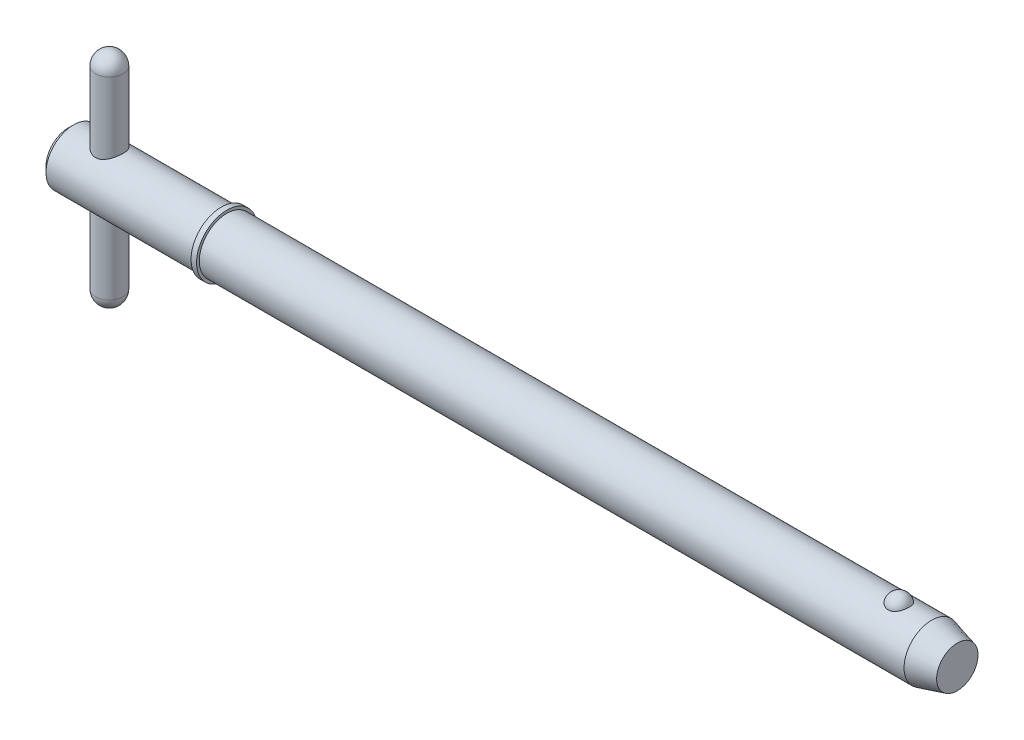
ISO-10303-21;
HEADER;
FILE_DESCRIPTION(('STEP AP214'),'2;1');
FILE_NAME('part.step','',(''),(''),'','','');
FILE_SCHEMA(('AUTOMOTIVE_DESIGN { 1 0 10303 214 1 1 1 1 }'));
ENDSEC;
DATA;
#1=APPLICATION_CONTEXT('core data for automotive mechanical design processes');
#2=APPLICATION_PROTOCOL_DEFINITION('international standard','automotive_design',2000,#1);
#3=PRODUCT_CONTEXT('',#1,'mechanical');
#4=PRODUCT('Part','Part','',(#3));
#5=PRODUCT_RELATED_PRODUCT_CATEGORY('part','',(#4));
#6=PRODUCT_DEFINITION_FORMATION('','',#4);
#7=PRODUCT_DEFINITION_CONTEXT('part definition',#1,'design');
#8=PRODUCT_DEFINITION('design','',#6,#7);
#9=PRODUCT_DEFINITION_SHAPE('','',#8);
#10=(LENGTH_UNIT() NAMED_UNIT(*) SI_UNIT(.MILLI.,.METRE.));
#11=(NAMED_UNIT(*) PLANE_ANGLE_UNIT() SI_UNIT($,.RADIAN.));
#12=(NAMED_UNIT(*) SI_UNIT($,.STERADIAN.) SOLID_ANGLE_UNIT());
#13=UNCERTAINTY_MEASURE_WITH_UNIT(LENGTH_MEASURE(1.E-05),#10,'distance_accuracy_value','');
#14=(GEOMETRIC_REPRESENTATION_CONTEXT(3) GLOBAL_UNCERTAINTY_ASSIGNED_CONTEXT((#13)) GLOBAL_UNIT_ASSIGNED_CONTEXT((#10,
#11,#12)) REPRESENTATION_CONTEXT('',''));
#15=CARTESIAN_POINT('',(0.,0.,0.));
#16=DIRECTION('',(0.,0.,1.));
#17=DIRECTION('',(1.,0.,0.));
#18=AXIS2_PLACEMENT_3D('',#15,#16,#17);
#19=CARTESIAN_POINT('',(4.755,12.7,0.));
#20=DIRECTION('',(0.,-1.,0.));
#21=DIRECTION('',(0.,0.,-1.));
#22=AXIS2_PLACEMENT_3D('',#19,#20,#21);
#23=CYLINDRICAL_SURFACE('',#22,1.585);
#24=CARTESIAN_POINT('',(4.755,-11.115,0.));
#25=DIRECTION('',(0.,-1.,0.));
#26=DIRECTION('',(0.,0.,-1.));
#27=AXIS2_PLACEMENT_3D('',#24,#25,#26);
#28=CIRCLE('',#27,1.585);
#29=CARTESIAN_POINT('',(4.755,-11.115,-1.585));
#30=VERTEX_POINT('',#29);
#31=EDGE_CURVE('P0_E10',#30,#30,#28,.F.);
#32=ORIENTED_EDGE('',*,*,#31,.T.);
#33=EDGE_LOOP('',(#32));
#34=FACE_BOUND('',#33,.T.);
#35=CARTESIAN_POINT('',(4.755,11.115,0.));
#36=DIRECTION('',(0.,-1.,0.));
#37=DIRECTION('',(0.,0.,-1.));
#38=AXIS2_PLACEMENT_3D('',#35,#36,#37);
#39=CIRCLE('',#38,1.585);
#40=CARTESIAN_POINT('',(4.755,11.115,-1.585));
#41=VERTEX_POINT('',#40);
#42=EDGE_CURVE('P0_E21',#41,#41,#39,.T.);
#43=ORIENTED_EDGE('',*,*,#42,.T.);
#44=EDGE_LOOP('',(#43));
#45=FACE_BOUND('',#44,.T.);
#46=ADVANCED_FACE('P0_F14',(#34,#45),#23,.T.);
#47=CARTESIAN_POINT('',(4.755,-11.115,0.));
#48=DIRECTION('',(0.,0.,1.));
#49=DIRECTION('',(1.,0.,0.));
#50=AXIS2_PLACEMENT_3D('',#47,#48,#49);
#51=SPHERICAL_SURFACE('',#50,1.585);
#52=CARTESIAN_POINT('',(4.755,-11.115,0.));
#53=DIRECTION('',(0.,-1.,0.));
#54=DIRECTION('',(0.,0.,-1.));
#55=AXIS2_PLACEMENT_3D('',#52,#53,#54);
#56=SPHERICAL_SURFACE('',#55,1.585);
#57=ORIENTED_EDGE('',*,*,#31,.F.);
#58=EDGE_LOOP('',(#57));
#59=FACE_BOUND('',#58,.T.);
#60=ADVANCED_FACE('P0_F29',(#59),#56,.T.);
#61=CARTESIAN_POINT('',(4.755,11.115,0.));
#62=DIRECTION('',(0.,0.,1.));
#63=DIRECTION('',(1.,0.,0.));
#64=AXIS2_PLACEMENT_3D('',#61,#62,#63);
#65=SPHERICAL_SURFACE('',#64,1.585);
#66=CARTESIAN_POINT('',(4.755,11.115,0.));
#67=DIRECTION('',(0.,-1.,0.));
#68=DIRECTION('',(0.,0.,-1.));
#69=AXIS2_PLACEMENT_3D('',#66,#67,#68);
#70=SPHERICAL_SURFACE('',#69,1.585);
#71=ORIENTED_EDGE('',*,*,#42,.F.);
#72=EDGE_LOOP('',(#71));
#73=FACE_BOUND('',#72,.T.);
#74=ADVANCED_FACE('P0_F16',(#73),#70,.T.);
#75=CLOSED_SHELL('',(#46,#60,#74));
#76=MANIFOLD_SOLID_BREP('P0_B1',#75);
#77=CARTESIAN_POINT('',(0.,0.,0.));
#78=DIRECTION('',(1.,0.,0.));
#79=DIRECTION('',(0.,0.,-1.));
#80=AXIS2_PLACEMENT_3D('',#77,#78,#79);
#81=CYLINDRICAL_SURFACE('',#80,3.175);
#82=CARTESIAN_POINT('',(99.4476846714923,0.,0.));
#83=DIRECTION('',(1.,0.,0.));
#84=DIRECTION('',(0.,0.,-1.));
#85=AXIS2_PLACEMENT_3D('',#82,#83,#84);
#86=CIRCLE('',#85,3.175);
#87=CARTESIAN_POINT('',(99.4476846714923,0.,-3.175));
#88=VERTEX_POINT('',#87);
#89=EDGE_CURVE('P1_E81',#88,#88,#86,.T.);
#90=ORIENTED_EDGE('',*,*,#89,.F.);
#91=EDGE_LOOP('',(#90));
#92=FACE_BOUND('',#91,.T.);
#93=CARTESIAN_POINT('',(18.29,0.,0.));
#94=DIRECTION('',(1.,0.,0.));
#95=DIRECTION('',(0.,0.,-1.));
#96=AXIS2_PLACEMENT_3D('',#93,#94,#95);
#97=CIRCLE('',#96,3.175);
#98=CARTESIAN_POINT('',(18.29,0.,-3.175));
#99=VERTEX_POINT('',#98);
#100=EDGE_CURVE('P1_E85',#99,#99,#97,.T.);
#101=ORIENTED_EDGE('',*,*,#100,.T.);
#102=EDGE_LOOP('',(#101));
#103=FACE_BOUND('',#102,.T.);
#104=CARTESIAN_POINT('',(95.6757276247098,2.92898950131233,1.2254164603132));
#105=CARTESIAN_POINT('',(95.612316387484,2.92899434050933,1.22541146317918));
#106=CARTESIAN_POINT('',(95.5487979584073,2.93112688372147,1.2203464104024));
#107=CARTESIAN_POINT('',(95.4235306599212,2.93942752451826,1.20020949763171));
#108=CARTESIAN_POINT('',(95.3617869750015,2.9456063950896,1.1851109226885));
#109=CARTESIAN_POINT('',(95.2420651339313,2.96127115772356,1.14540352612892));
#110=CARTESIAN_POINT('',(95.1840775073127,2.97074831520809,1.12081980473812));
#111=CARTESIAN_POINT('',(95.0731943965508,2.99197584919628,1.06285154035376));
#112=CARTESIAN_POINT('',(95.0202966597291,3.0037252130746,1.02947091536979));
#113=CARTESIAN_POINT('',(94.9192688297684,3.02865714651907,0.953674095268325));
#114=CARTESIAN_POINT('',(94.871324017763,3.04187163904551,0.911021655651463));
#115=CARTESIAN_POINT('',(94.7830360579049,3.06808741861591,0.818400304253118));
#116=CARTESIAN_POINT('',(94.7426952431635,3.08108863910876,0.768429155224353));
#117=CARTESIAN_POINT('',(94.6688039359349,3.10614903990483,0.660064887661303));
#118=CARTESIAN_POINT('',(94.6356330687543,3.11814104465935,0.601396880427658));
#119=CARTESIAN_POINT('',(94.5791190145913,3.13926931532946,0.479026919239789));
#120=CARTESIAN_POINT('',(94.5557764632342,3.14840539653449,0.415324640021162));
#121=CARTESIAN_POINT('',(94.5191785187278,3.16298160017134,0.283885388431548));
#122=CARTESIAN_POINT('',(94.5060407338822,3.16837855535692,0.216110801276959));
#123=CARTESIAN_POINT('',(94.4905676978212,3.17475386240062,0.0791367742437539));
#124=CARTESIAN_POINT('',(94.488232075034,3.17573236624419,0.00993738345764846));
#125=CARTESIAN_POINT('',(94.4943886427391,3.17318075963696,-0.127420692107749));
#126=CARTESIAN_POINT('',(94.5028073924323,3.16968122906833,-0.19558325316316));
#127=CARTESIAN_POINT('',(94.5301752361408,3.1585790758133,-0.329413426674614));
#128=CARTESIAN_POINT('',(94.5491245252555,3.15097637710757,-0.395080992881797));
#129=CARTESIAN_POINT('',(94.5972057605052,3.13242485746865,-0.5221806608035));
#130=CARTESIAN_POINT('',(94.6263524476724,3.12147119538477,-0.583606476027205));
#131=CARTESIAN_POINT('',(94.6942352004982,3.09734973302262,-0.700436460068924));
#132=CARTESIAN_POINT('',(94.732972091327,3.08418174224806,-0.755840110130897));
#133=CARTESIAN_POINT('',(94.8194771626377,3.05694884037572,-0.859404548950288));
#134=CARTESIAN_POINT('',(94.8672961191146,3.04287919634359,-0.907521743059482));
#135=CARTESIAN_POINT('',(94.9707353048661,3.01548927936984,-0.994758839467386));
#136=CARTESIAN_POINT('',(95.0263549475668,3.0021689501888,-1.03387941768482));
#137=CARTESIAN_POINT('',(95.1428093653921,2.97810316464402,-1.10126594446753));
#138=CARTESIAN_POINT('',(95.2035182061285,2.96731170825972,-1.12973256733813));
#139=CARTESIAN_POINT('',(95.3293712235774,2.94928934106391,-1.17598467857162));
#140=CARTESIAN_POINT('',(95.3945137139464,2.94205708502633,-1.19377420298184));
#141=CARTESIAN_POINT('',(95.5238562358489,2.93233065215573,-1.21746387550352));
#142=CARTESIAN_POINT('',(95.5879385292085,2.92961621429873,-1.22391763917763));
#143=CARTESIAN_POINT('',(95.7163375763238,2.92855752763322,-1.22644976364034));
#144=CARTESIAN_POINT('',(95.7806542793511,2.93021238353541,-1.22253024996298));
#145=CARTESIAN_POINT('',(95.9055239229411,2.9375685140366,-1.20474140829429));
#146=CARTESIAN_POINT('',(95.966131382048,2.94313790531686,-1.19119621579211));
#147=CARTESIAN_POINT('',(96.0841106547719,2.95756226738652,-1.15491492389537));
#148=CARTESIAN_POINT('',(96.1414822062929,2.96641750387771,-1.13217808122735));
#149=CARTESIAN_POINT('',(96.2527699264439,2.98669918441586,-1.07755083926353));
#150=CARTESIAN_POINT('',(96.3065845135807,2.9981771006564,-1.04547308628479));
#151=CARTESIAN_POINT('',(96.4081473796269,3.02240235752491,-0.973220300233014));
#152=CARTESIAN_POINT('',(96.4558942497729,3.03514999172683,-0.933043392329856));
#153=CARTESIAN_POINT('',(96.5465817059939,3.06131230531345,-0.843372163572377));
#154=CARTESIAN_POINT('',(96.5891588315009,3.07472822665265,-0.793510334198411));
#155=CARTESIAN_POINT('',(96.6656765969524,3.10021106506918,-0.687241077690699));
#156=CARTESIAN_POINT('',(96.6996156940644,3.1122777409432,-0.630832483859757));
#157=CARTESIAN_POINT('',(96.7591209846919,3.134208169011,-0.51105938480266));
#158=CARTESIAN_POINT('',(96.7843892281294,3.14399040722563,-0.447531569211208));
#159=CARTESIAN_POINT('',(96.8245117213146,3.15983820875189,-0.31682749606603));
#160=CARTESIAN_POINT('',(96.8393659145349,3.16590375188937,-0.249651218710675));
#161=CARTESIAN_POINT('',(96.858358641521,3.17370076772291,-0.113549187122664));
#162=CARTESIAN_POINT('',(96.8624966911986,3.17543204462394,-0.0446233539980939));
#163=CARTESIAN_POINT('',(96.8599697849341,3.17438372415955,0.0929938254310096));
#164=CARTESIAN_POINT('',(96.8533050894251,3.17160423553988,0.16168517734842));
#165=CARTESIAN_POINT('',(96.8293754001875,3.1618438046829,0.296502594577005));
#166=CARTESIAN_POINT('',(96.8121674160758,3.15488546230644,0.362640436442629));
#167=CARTESIAN_POINT('',(96.767547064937,3.13748892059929,0.490896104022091));
#168=CARTESIAN_POINT('',(96.7401339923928,3.12705048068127,0.553013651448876));
#169=CARTESIAN_POINT('',(96.6754626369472,3.10369139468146,0.671876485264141));
#170=CARTESIAN_POINT('',(96.6381467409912,3.0907563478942,0.728587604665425));
#171=CARTESIAN_POINT('',(96.5545246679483,3.06381731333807,0.834653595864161));
#172=CARTESIAN_POINT('',(96.5082189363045,3.04981337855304,0.884008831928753));
#173=CARTESIAN_POINT('',(96.407718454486,3.02230423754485,0.973916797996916));
#174=CARTESIAN_POINT('',(96.353535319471,3.00879833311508,1.01448227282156));
#175=CARTESIAN_POINT('',(96.2385299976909,2.98383625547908,1.0857155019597));
#176=CARTESIAN_POINT('',(96.1777053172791,2.9723808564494,1.11637952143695));
#177=CARTESIAN_POINT('',(96.0533690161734,2.95329063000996,1.16592590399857));
#178=CARTESIAN_POINT('',(95.9900230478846,2.9455373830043,1.18517901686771));
#179=CARTESIAN_POINT('',(95.8607664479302,2.9342556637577,1.21284802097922));
#180=CARTESIAN_POINT('',(95.7948641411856,2.93071450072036,1.2212964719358));
#181=CARTESIAN_POINT('',(95.711116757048,2.9291525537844,1.22502505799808));
#182=CARTESIAN_POINT('',(95.6934263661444,2.92898815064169,1.22541785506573));
#183=CARTESIAN_POINT('',(95.6757276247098,2.92898950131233,1.2254164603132));
#184=B_SPLINE_CURVE_WITH_KNOTS('',3,(#104,#105,#106,#107,#108,#109,#110,#111,#112,#113,#114,
#115,#116,#117,#118,#119,#120,#121,#122,#123,#124,#125,#126,#127,#128,#129,#130,#131,#132,#133,
#134,#135,#136,#137,#138,#139,#140,#141,#142,#143,#144,#145,#146,#147,#148,#149,#150,#151,#152,
#153,#154,#155,#156,#157,#158,#159,#160,#161,#162,#163,#164,#165,#166,#167,#168,#169,#170,#171,
#172,#173,#174,#175,#176,#177,#178,#179,#180,#181,#182,#183),.UNSPECIFIED.,.T.,.F.,(4,2,2,2,2,2,
2,2,2,2,2,2,2,2,2,2,2,2,2,2,2,2,2,2,2,2,2,2,2,2,2,2,2,2,2,2,2,2,2,4),(0.,0.190186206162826,
0.380880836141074,0.571074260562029,0.761183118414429,0.956866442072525,1.15260970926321,
1.3570177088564,1.56143892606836,1.76818248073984,1.97491892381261,2.18025109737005,
2.38558707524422,2.59122111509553,2.79687285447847,3.00371012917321,3.2105318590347,
3.41323429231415,3.61586005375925,3.80828192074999,4.00066436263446,4.18685798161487,
4.37306665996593,4.56330302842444,4.75358348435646,4.95345287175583,5.15335793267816,
5.35957003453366,5.56578325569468,5.7720057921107,5.97822335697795,6.18333558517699,
6.38846199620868,6.59480900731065,6.80114579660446,7.00718137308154,7.21329457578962,
7.41228022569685,7.61066481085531,7.66374777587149),.UNSPECIFIED.);
#185=CARTESIAN_POINT('',(95.6757276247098,2.92898950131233,1.2254164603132));
#186=VERTEX_POINT('',#185);
#187=EDGE_CURVE('P1_E35',#186,#186,#184,.T.);
#188=ORIENTED_EDGE('',*,*,#187,.T.);
#189=EDGE_LOOP('',(#188));
#190=FACE_BOUND('',#189,.T.);
#191=ADVANCED_FACE('P1_F13',(#92,#103,#190),#81,.T.);
#192=CARTESIAN_POINT('',(0.,0.,0.));
#193=DIRECTION('',(-1.,0.,0.));
#194=DIRECTION('',(0.,0.,1.));
#195=AXIS2_PLACEMENT_3D('',#192,#193,#194);
#196=PLANE('',#195);
#197=CARTESIAN_POINT('',(0.,0.,0.));
#198=DIRECTION('',(1.,0.,0.));
#199=DIRECTION('',(0.,0.,-1.));
#200=AXIS2_PLACEMENT_3D('',#197,#198,#199);
#201=CIRCLE('',#200,2.54);
#202=CARTESIAN_POINT('',(0.,0.,-2.54));
#203=VERTEX_POINT('',#202);
#204=EDGE_CURVE('P1_E9',#203,#203,#201,.T.);
#205=ORIENTED_EDGE('',*,*,#204,.F.);
#206=EDGE_LOOP('',(#205));
#207=FACE_BOUND('',#206,.T.);
#208=ADVANCED_FACE('P1_F15',(#207),#196,.T.);
#209=CARTESIAN_POINT('',(0.634999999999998,0.,0.));
#210=DIRECTION('',(1.,0.,0.));
#211=DIRECTION('',(0.,0.,-1.));
#212=AXIS2_PLACEMENT_3D('',#209,#210,#211);
#213=CONICAL_SURFACE('',#212,3.175,0.78539816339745);
#214=ORIENTED_EDGE('',*,*,#204,.T.);
#215=EDGE_LOOP('',(#214));
#216=FACE_BOUND('',#215,.T.);
#217=CARTESIAN_POINT('',(0.634999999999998,0.,0.));
#218=DIRECTION('',(1.,0.,0.));
#219=DIRECTION('',(0.,0.,-1.));
#220=AXIS2_PLACEMENT_3D('',#217,#218,#219);
#221=CIRCLE('',#220,3.175);
#222=CARTESIAN_POINT('',(0.634999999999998,0.,-3.175));
#223=VERTEX_POINT('',#222);
#224=EDGE_CURVE('P1_E26',#223,#223,#221,.T.);
#225=ORIENTED_EDGE('',*,*,#224,.F.);
#226=EDGE_LOOP('',(#225));
#227=FACE_BOUND('',#226,.T.);
#228=ADVANCED_FACE('P1_F77',(#216,#227),#213,.T.);
#229=CARTESIAN_POINT('',(0.,0.,0.));
#230=DIRECTION('',(1.,0.,0.));
#231=DIRECTION('',(0.,0.,-1.));
#232=AXIS2_PLACEMENT_3D('',#229,#230,#231);
#233=CYLINDRICAL_SURFACE('',#232,3.175);
#234=CARTESIAN_POINT('',(4.755,-2.75107251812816,1.585));
#235=CARTESIAN_POINT('',(4.67238891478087,-2.7510796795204,1.58499425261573));
#236=CARTESIAN_POINT('',(4.58967306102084,-2.75485010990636,1.57849830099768));
#237=CARTESIAN_POINT('',(4.42677850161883,-2.76938647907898,1.55284486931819));
#238=CARTESIAN_POINT('',(4.34660551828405,-2.78016716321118,1.53366069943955));
#239=CARTESIAN_POINT('',(4.19146029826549,-2.80716278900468,1.48366329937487));
#240=CARTESIAN_POINT('',(4.11646293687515,-2.8233488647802,1.45291173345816));
#241=CARTESIAN_POINT('',(3.97271079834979,-2.85928672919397,1.38084067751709));
#242=CARTESIAN_POINT('',(3.90395634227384,-2.87903870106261,1.33952064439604));
#243=CARTESIAN_POINT('',(3.76839976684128,-2.921867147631,1.24350234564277));
#244=CARTESIAN_POINT('',(3.702222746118,-2.94508343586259,1.18798355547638));
#245=CARTESIAN_POINT('',(3.5796334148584,-2.99109588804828,1.06685014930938));
#246=CARTESIAN_POINT('',(3.52322596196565,-3.01389183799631,1.00123054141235));
#247=CARTESIAN_POINT('',(3.41807024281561,-3.05832598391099,0.856373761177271));
#248=CARTESIAN_POINT('',(3.37009053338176,-3.07978367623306,0.776518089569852));
#249=CARTESIAN_POINT('',(3.28853137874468,-3.11730894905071,0.608596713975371));
#250=CARTESIAN_POINT('',(3.25494287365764,-3.1333799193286,0.520536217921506));
#251=CARTESIAN_POINT('',(3.20559401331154,-3.15731341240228,0.345327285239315));
#252=CARTESIAN_POINT('',(3.18873760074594,-3.16567752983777,0.258557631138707));
#253=CARTESIAN_POINT('',(3.16972238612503,-3.17512718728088,0.0830496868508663));
#254=CARTESIAN_POINT('',(3.16755472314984,-3.17621711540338,-0.00568738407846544));
#255=CARTESIAN_POINT('',(3.1775542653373,-3.17123385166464,-0.174372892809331));
#256=CARTESIAN_POINT('',(3.18849502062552,-3.16577346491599,-0.254416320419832));
#257=CARTESIAN_POINT('',(3.22220680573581,-3.14922844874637,-0.411354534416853));
#258=CARTESIAN_POINT('',(3.2449787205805,-3.13814339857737,-0.488249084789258));
#259=CARTESIAN_POINT('',(3.30185558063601,-3.111172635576,-0.638050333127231));
#260=CARTESIAN_POINT('',(3.33611332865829,-3.09522247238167,-0.710886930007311));
#261=CARTESIAN_POINT('',(3.41477890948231,-3.05996035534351,-0.849953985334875));
#262=CARTESIAN_POINT('',(3.45919037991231,-3.04064719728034,-0.916182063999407));
#263=CARTESIAN_POINT('',(3.5617148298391,-2.99832415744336,-1.04681642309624));
#264=CARTESIAN_POINT('',(3.62072497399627,-2.97513741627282,-1.11046186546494));
#265=CARTESIAN_POINT('',(3.7483697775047,-2.92885066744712,-1.22736291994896));
#266=CARTESIAN_POINT('',(3.81701173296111,-2.90575073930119,-1.2806105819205));
#267=CARTESIAN_POINT('',(3.96727993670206,-2.86067370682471,-1.37849835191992));
#268=CARTESIAN_POINT('',(4.04945242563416,-2.83885964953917,-1.42238246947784));
#269=CARTESIAN_POINT('',(4.2213558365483,-2.80110454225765,-1.49537418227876));
#270=CARTESIAN_POINT('',(4.3110787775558,-2.78515738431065,-1.52449715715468));
#271=CARTESIAN_POINT('',(4.48806324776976,-2.76271292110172,-1.56478065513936));
#272=CARTESIAN_POINT('',(4.57495732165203,-2.75556745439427,-1.57718067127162));
#273=CARTESIAN_POINT('',(4.74985771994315,-2.74969306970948,-1.58740564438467));
#274=CARTESIAN_POINT('',(4.8378632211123,-2.75095824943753,-1.58524082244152));
#275=CARTESIAN_POINT('',(5.00227282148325,-2.76107477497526,-1.56753530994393));
#276=CARTESIAN_POINT('',(5.07889680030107,-2.76908515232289,-1.55347662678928));
#277=CARTESIAN_POINT('',(5.22855309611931,-2.79054849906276,-1.51458035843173));
#278=CARTESIAN_POINT('',(5.30158424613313,-2.80400322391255,-1.489739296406));
#279=CARTESIAN_POINT('',(5.44583114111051,-2.83556995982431,-1.42877335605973));
#280=CARTESIAN_POINT('',(5.51680600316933,-2.85386886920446,-1.39217900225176));
#281=CARTESIAN_POINT('',(5.6520174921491,-2.89289503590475,-1.30915485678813));
#282=CARTESIAN_POINT('',(5.71625063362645,-2.91362353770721,-1.26272001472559));
#283=CARTESIAN_POINT('',(5.8445938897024,-2.95830220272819,-1.15451693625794));
#284=CARTESIAN_POINT('',(5.90767560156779,-2.98233004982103,-1.09155543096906));
#285=CARTESIAN_POINT('',(6.0226995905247,-3.02864458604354,-0.955560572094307));
#286=CARTESIAN_POINT('',(6.07463814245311,-3.05093069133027,-0.882523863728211));
#287=CARTESIAN_POINT('',(6.16704288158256,-3.09200671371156,-0.725836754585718));
#288=CARTESIAN_POINT('',(6.20717458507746,-3.11069030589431,-0.64195924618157));
#289=CARTESIAN_POINT('',(6.27235859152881,-3.1416474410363,-0.467442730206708));
#290=CARTESIAN_POINT('',(6.29742409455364,-3.15392659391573,-0.376809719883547));
#291=CARTESIAN_POINT('',(6.32960989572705,-3.16979844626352,-0.200314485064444));
#292=CARTESIAN_POINT('',(6.33816324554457,-3.17408359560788,-0.114775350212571));
#293=CARTESIAN_POINT('',(6.34130309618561,-3.17565001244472,0.0566108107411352));
#294=CARTESIAN_POINT('',(6.33589445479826,-3.17293371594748,0.142457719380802));
#295=CARTESIAN_POINT('',(6.31221457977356,-3.16120608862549,0.306097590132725));
#296=CARTESIAN_POINT('',(6.2948097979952,-3.15261910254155,0.38404960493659));
#297=CARTESIAN_POINT('',(6.24879775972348,-3.13040364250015,0.535801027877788));
#298=CARTESIAN_POINT('',(6.22018889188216,-3.11677444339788,0.609599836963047));
#299=CARTESIAN_POINT('',(6.15130303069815,-3.08497808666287,0.754502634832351));
#300=CARTESIAN_POINT('',(6.11057850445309,-3.0666414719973,0.82535556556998));
#301=CARTESIAN_POINT('',(6.01917980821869,-3.02735012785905,0.95951596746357));
#302=CARTESIAN_POINT('',(5.96850106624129,-3.00639419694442,1.02281994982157));
#303=CARTESIAN_POINT('',(5.8528006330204,-2.96149402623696,1.1467073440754));
#304=CARTESIAN_POINT('',(5.78685463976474,-2.93745961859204,1.20639723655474));
#305=CARTESIAN_POINT('',(5.64552278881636,-2.89084502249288,1.31419099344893));
#306=CARTESIAN_POINT('',(5.57012871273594,-2.8682661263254,1.36228466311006));
#307=CARTESIAN_POINT('',(5.40892145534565,-2.82661780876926,1.44677201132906));
#308=CARTESIAN_POINT('',(5.32285703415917,-2.80767948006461,1.48275497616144));
#309=CARTESIAN_POINT('',(5.14469010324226,-2.77716572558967,1.53916557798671));
#310=CARTESIAN_POINT('',(5.05260892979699,-2.76556569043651,1.55964525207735));
#311=CARTESIAN_POINT('',(4.92544162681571,-2.75613775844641,1.57618070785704));
#312=CARTESIAN_POINT('',(4.89147210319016,-2.75424493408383,1.57948285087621));
#313=CARTESIAN_POINT('',(4.82334103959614,-2.75171079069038,1.58389375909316));
#314=CARTESIAN_POINT('',(4.78917948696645,-2.75106955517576,1.58500237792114));
#315=CARTESIAN_POINT('',(4.755,-2.75107251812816,1.585));
#316=B_SPLINE_CURVE_WITH_KNOTS('',3,(#234,#235,#236,#237,#238,#239,#240,#241,#242,#243,#244,
#245,#246,#247,#248,#249,#250,#251,#252,#253,#254,#255,#256,#257,#258,#259,#260,#261,#262,#263,
#264,#265,#266,#267,#268,#269,#270,#271,#272,#273,#274,#275,#276,#277,#278,#279,#280,#281,#282,
#283,#284,#285,#286,#287,#288,#289,#290,#291,#292,#293,#294,#295,#296,#297,#298,#299,#300,#301,
#302,#303,#304,#305,#306,#307,#308,#309,#310,#311,#312,#313,#314,#315),.UNSPECIFIED.,.T.,.F.,(4,
2,2,2,2,2,2,2,2,2,2,2,2,2,2,2,2,2,2,2,2,2,2,2,2,2,2,2,2,2,2,2,2,2,2,2,2,2,2,2,4),(0.,
0.247689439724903,0.495901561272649,0.742808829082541,0.989728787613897,1.25694656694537,
1.52429683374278,1.80959781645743,2.0947189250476,2.35960564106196,2.62433255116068,
2.86610932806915,3.1079041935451,3.35305262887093,3.59828902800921,3.86665310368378,
4.13522157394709,4.4207514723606,4.70598326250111,4.9686344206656,5.23110127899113,
5.46499114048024,5.69895647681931,5.94376186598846,6.1886932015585,6.46438263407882,
6.74016408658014,7.0231370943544,7.30586181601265,7.5626977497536,7.81944433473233,
8.05935987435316,8.29930993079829,8.54954401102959,8.79989329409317,9.07508848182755,
9.35052473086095,9.63453318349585,9.91758407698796,10.0200561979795,10.1225351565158),.UNSPECIFIED.);
#317=CARTESIAN_POINT('',(4.755,-2.75107251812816,1.585));
#318=VERTEX_POINT('',#317);
#319=EDGE_CURVE('P1_E17',#318,#318,#316,.T.);
#320=ORIENTED_EDGE('',*,*,#319,.F.);
#321=EDGE_LOOP('',(#320));
#322=FACE_BOUND('',#321,.T.);
#323=CARTESIAN_POINT('',(4.755,2.75107251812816,1.585));
#324=CARTESIAN_POINT('',(4.83761108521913,2.7510796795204,1.58499425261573));
#325=CARTESIAN_POINT('',(4.92032693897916,2.75485010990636,1.57849830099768));
#326=CARTESIAN_POINT('',(5.08322149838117,2.76938647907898,1.55284486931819));
#327=CARTESIAN_POINT('',(5.16339448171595,2.78016716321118,1.53366069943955));
#328=CARTESIAN_POINT('',(5.31853970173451,2.80716278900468,1.48366329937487));
#329=CARTESIAN_POINT('',(5.39353706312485,2.8233488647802,1.45291173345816));
#330=CARTESIAN_POINT('',(5.53728920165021,2.85928672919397,1.38084067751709));
#331=CARTESIAN_POINT('',(5.60604365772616,2.87903870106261,1.33952064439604));
#332=CARTESIAN_POINT('',(5.74160023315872,2.921867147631,1.24350234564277));
#333=CARTESIAN_POINT('',(5.807777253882,2.94508343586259,1.18798355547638));
#334=CARTESIAN_POINT('',(5.9303665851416,2.99109588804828,1.06685014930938));
#335=CARTESIAN_POINT('',(5.98677403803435,3.01389183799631,1.00123054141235));
#336=CARTESIAN_POINT('',(6.09192975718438,3.05832598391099,0.85637376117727));
#337=CARTESIAN_POINT('',(6.13990946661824,3.07978367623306,0.776518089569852));
#338=CARTESIAN_POINT('',(6.22146862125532,3.11730894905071,0.608596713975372));
#339=CARTESIAN_POINT('',(6.25505712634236,3.1333799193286,0.520536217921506));
#340=CARTESIAN_POINT('',(6.30440598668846,3.15731341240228,0.345327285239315));
#341=CARTESIAN_POINT('',(6.32126239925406,3.16567752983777,0.258557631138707));
#342=CARTESIAN_POINT('',(6.34027761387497,3.17512718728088,0.0830496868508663));
#343=CARTESIAN_POINT('',(6.34244527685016,3.17621711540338,-0.00568738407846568));
#344=CARTESIAN_POINT('',(6.3324457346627,3.17123385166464,-0.174372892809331));
#345=CARTESIAN_POINT('',(6.32150497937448,3.16577346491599,-0.254416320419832));
#346=CARTESIAN_POINT('',(6.28779319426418,3.14922844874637,-0.411354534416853));
#347=CARTESIAN_POINT('',(6.2650212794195,3.13814339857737,-0.488249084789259));
#348=CARTESIAN_POINT('',(6.20814441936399,3.111172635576,-0.638050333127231));
#349=CARTESIAN_POINT('',(6.17388667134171,3.09522247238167,-0.710886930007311));
#350=CARTESIAN_POINT('',(6.09522109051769,3.05996035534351,-0.849953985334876));
#351=CARTESIAN_POINT('',(6.05080962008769,3.04064719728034,-0.916182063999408));
#352=CARTESIAN_POINT('',(5.9482851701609,2.99832415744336,-1.04681642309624));
#353=CARTESIAN_POINT('',(5.88927502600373,2.97513741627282,-1.11046186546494));
#354=CARTESIAN_POINT('',(5.7616302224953,2.92885066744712,-1.22736291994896));
#355=CARTESIAN_POINT('',(5.69298826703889,2.90575073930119,-1.2806105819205));
#356=CARTESIAN_POINT('',(5.54272006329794,2.86067370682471,-1.37849835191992));
#357=CARTESIAN_POINT('',(5.46054757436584,2.83885964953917,-1.42238246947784));
#358=CARTESIAN_POINT('',(5.2886441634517,2.80110454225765,-1.49537418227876));
#359=CARTESIAN_POINT('',(5.19892122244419,2.78515738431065,-1.52449715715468));
#360=CARTESIAN_POINT('',(5.02193675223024,2.76271292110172,-1.56478065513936));
#361=CARTESIAN_POINT('',(4.93504267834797,2.75556745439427,-1.57718067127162));
#362=CARTESIAN_POINT('',(4.76014228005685,2.74969306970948,-1.58740564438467));
#363=CARTESIAN_POINT('',(4.6721367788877,2.75095824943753,-1.58524082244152));
#364=CARTESIAN_POINT('',(4.50772717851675,2.76107477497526,-1.56753530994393));
#365=CARTESIAN_POINT('',(4.43110319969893,2.76908515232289,-1.55347662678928));
#366=CARTESIAN_POINT('',(4.28144690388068,2.79054849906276,-1.51458035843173));
#367=CARTESIAN_POINT('',(4.20841575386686,2.80400322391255,-1.489739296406));
#368=CARTESIAN_POINT('',(4.06416885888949,2.83556995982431,-1.42877335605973));
#369=CARTESIAN_POINT('',(3.99319399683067,2.85386886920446,-1.39217900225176));
#370=CARTESIAN_POINT('',(3.8579825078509,2.89289503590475,-1.30915485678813));
#371=CARTESIAN_POINT('',(3.79374936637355,2.91362353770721,-1.26272001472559));
#372=CARTESIAN_POINT('',(3.6654061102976,2.95830220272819,-1.15451693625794));
#373=CARTESIAN_POINT('',(3.60232439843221,2.98233004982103,-1.09155543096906));
#374=CARTESIAN_POINT('',(3.4873004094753,3.02864458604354,-0.955560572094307));
#375=CARTESIAN_POINT('',(3.43536185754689,3.05093069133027,-0.88252386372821));
#376=CARTESIAN_POINT('',(3.34295711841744,3.09200671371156,-0.725836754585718));
#377=CARTESIAN_POINT('',(3.30282541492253,3.11069030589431,-0.64195924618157));
#378=CARTESIAN_POINT('',(3.23764140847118,3.14164744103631,-0.467442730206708));
#379=CARTESIAN_POINT('',(3.21257590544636,3.15392659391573,-0.376809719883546));
#380=CARTESIAN_POINT('',(3.18039010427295,3.16979844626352,-0.200314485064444));
#381=CARTESIAN_POINT('',(3.17183675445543,3.17408359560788,-0.114775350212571));
#382=CARTESIAN_POINT('',(3.16869690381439,3.17565001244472,0.0566108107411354));
#383=CARTESIAN_POINT('',(3.17410554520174,3.17293371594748,0.142457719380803));
#384=CARTESIAN_POINT('',(3.19778542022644,3.16120608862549,0.306097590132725));
#385=CARTESIAN_POINT('',(3.2151902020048,3.15261910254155,0.384049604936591));
#386=CARTESIAN_POINT('',(3.26120224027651,3.13040364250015,0.535801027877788));
#387=CARTESIAN_POINT('',(3.28981110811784,3.11677444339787,0.609599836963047));
#388=CARTESIAN_POINT('',(3.35869696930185,3.08497808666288,0.754502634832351));
#389=CARTESIAN_POINT('',(3.39942149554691,3.0666414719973,0.82535556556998));
#390=CARTESIAN_POINT('',(3.49082019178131,3.02735012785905,0.95951596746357));
#391=CARTESIAN_POINT('',(3.54149893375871,3.00639419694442,1.02281994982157));
#392=CARTESIAN_POINT('',(3.6571993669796,2.96149402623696,1.1467073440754));
#393=CARTESIAN_POINT('',(3.72314536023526,2.93745961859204,1.20639723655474));
#394=CARTESIAN_POINT('',(3.86447721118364,2.89084502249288,1.31419099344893));
#395=CARTESIAN_POINT('',(3.93987128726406,2.8682661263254,1.36228466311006));
#396=CARTESIAN_POINT('',(4.10107854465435,2.82661780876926,1.44677201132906));
#397=CARTESIAN_POINT('',(4.18714296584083,2.80767948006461,1.48275497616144));
#398=CARTESIAN_POINT('',(4.36530989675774,2.77716572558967,1.53916557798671));
#399=CARTESIAN_POINT('',(4.45739107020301,2.76556569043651,1.55964525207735));
#400=CARTESIAN_POINT('',(4.58455837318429,2.75613775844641,1.57618070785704));
#401=CARTESIAN_POINT('',(4.61852789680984,2.75424493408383,1.57948285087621));
#402=CARTESIAN_POINT('',(4.68665896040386,2.75171079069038,1.58389375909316));
#403=CARTESIAN_POINT('',(4.72082051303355,2.75106955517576,1.58500237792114));
#404=CARTESIAN_POINT('',(4.755,2.75107251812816,1.585));
#405=B_SPLINE_CURVE_WITH_KNOTS('',3,(#323,#324,#325,#326,#327,#328,#329,#330,#331,#332,#333,
#334,#335,#336,#337,#338,#339,#340,#341,#342,#343,#344,#345,#346,#347,#348,#349,#350,#351,#352,
#353,#354,#355,#356,#357,#358,#359,#360,#361,#362,#363,#364,#365,#366,#367,#368,#369,#370,#371,
#372,#373,#374,#375,#376,#377,#378,#379,#380,#381,#382,#383,#384,#385,#386,#387,#388,#389,#390,
#391,#392,#393,#394,#395,#396,#397,#398,#399,#400,#401,#402,#403,#404),.UNSPECIFIED.,.T.,.F.,(4,
2,2,2,2,2,2,2,2,2,2,2,2,2,2,2,2,2,2,2,2,2,2,2,2,2,2,2,2,2,2,2,2,2,2,2,2,2,2,2,4),(0.,
0.247689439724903,0.495901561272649,0.742808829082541,0.989728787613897,1.25694656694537,
1.52429683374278,1.80959781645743,2.0947189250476,2.35960564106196,2.62433255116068,
2.86610932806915,3.1079041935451,3.35305262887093,3.59828902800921,3.86665310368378,
4.13522157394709,4.4207514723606,4.70598326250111,4.9686344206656,5.23110127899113,
5.46499114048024,5.69895647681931,5.94376186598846,6.1886932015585,6.46438263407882,
6.74016408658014,7.0231370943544,7.30586181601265,7.5626977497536,7.81944433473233,
8.05935987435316,8.29930993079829,8.54954401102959,8.79989329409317,9.07508848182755,
9.35052473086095,9.63453318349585,9.91758407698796,10.0200561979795,10.1225351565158),.UNSPECIFIED.);
#406=CARTESIAN_POINT('',(4.755,2.75107251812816,1.585));
#407=VERTEX_POINT('',#406);
#408=EDGE_CURVE('P1_E43',#407,#407,#405,.T.);
#409=ORIENTED_EDGE('',*,*,#408,.F.);
#410=EDGE_LOOP('',(#409));
#411=FACE_BOUND('',#410,.T.);
#412=ORIENTED_EDGE('',*,*,#224,.T.);
#413=EDGE_LOOP('',(#412));
#414=FACE_BOUND('',#413,.T.);
#415=CARTESIAN_POINT('',(17.655,0.,0.));
#416=DIRECTION('',(1.,0.,0.));
#417=DIRECTION('',(0.,0.,-1.));
#418=AXIS2_PLACEMENT_3D('',#415,#416,#417);
#419=CIRCLE('',#418,3.175);
#420=CARTESIAN_POINT('',(17.655,0.,-3.175));
#421=VERTEX_POINT('',#420);
#422=EDGE_CURVE('P1_E31',#421,#421,#419,.T.);
#423=ORIENTED_EDGE('',*,*,#422,.F.);
#424=EDGE_LOOP('',(#423));
#425=FACE_BOUND('',#424,.T.);
#426=ADVANCED_FACE('P1_F103',(#322,#411,#414,#425),#233,.T.);
#427=CARTESIAN_POINT('',(17.655,3.175,0.));
#428=DIRECTION('',(-1.,0.,0.));
#429=DIRECTION('',(0.,0.,1.));
#430=AXIS2_PLACEMENT_3D('',#427,#428,#429);
#431=PLANE('',#430);
#432=ORIENTED_EDGE('',*,*,#422,.T.);
#433=EDGE_LOOP('',(#432));
#434=FACE_BOUND('',#433,.T.);
#435=CARTESIAN_POINT('',(17.655,0.,0.));
#436=DIRECTION('',(1.,0.,0.));
#437=DIRECTION('',(0.,0.,-1.));
#438=AXIS2_PLACEMENT_3D('',#435,#436,#437);
#439=CIRCLE('',#438,3.4925);
#440=CARTESIAN_POINT('',(17.655,0.,-3.4925));
#441=VERTEX_POINT('',#440);
#442=EDGE_CURVE('P1_E91',#441,#441,#439,.T.);
#443=ORIENTED_EDGE('',*,*,#442,.F.);
#444=EDGE_LOOP('',(#443));
#445=FACE_BOUND('',#444,.T.);
#446=ADVANCED_FACE('P1_F100',(#434,#445),#431,.T.);
#447=CARTESIAN_POINT('',(0.,0.,0.));
#448=DIRECTION('',(1.,0.,0.));
#449=DIRECTION('',(0.,0.,-1.));
#450=AXIS2_PLACEMENT_3D('',#447,#448,#449);
#451=CYLINDRICAL_SURFACE('',#450,3.4925);
#452=ORIENTED_EDGE('',*,*,#442,.T.);
#453=EDGE_LOOP('',(#452));
#454=FACE_BOUND('',#453,.T.);
#455=CARTESIAN_POINT('',(18.29,0.,0.));
#456=DIRECTION('',(1.,0.,0.));
#457=DIRECTION('',(0.,0.,-1.));
#458=AXIS2_PLACEMENT_3D('',#455,#456,#457);
#459=CIRCLE('',#458,3.4925);
#460=CARTESIAN_POINT('',(18.29,0.,-3.4925));
#461=VERTEX_POINT('',#460);
#462=EDGE_CURVE('P1_E88',#461,#461,#459,.T.);
#463=ORIENTED_EDGE('',*,*,#462,.F.);
#464=EDGE_LOOP('',(#463));
#465=FACE_BOUND('',#464,.T.);
#466=ADVANCED_FACE('P1_F68',(#454,#465),#451,.T.);
#467=CARTESIAN_POINT('',(18.29,3.4925,0.));
#468=DIRECTION('',(1.,0.,0.));
#469=DIRECTION('',(0.,0.,-1.));
#470=AXIS2_PLACEMENT_3D('',#467,#468,#469);
#471=PLANE('',#470);
#472=ORIENTED_EDGE('',*,*,#462,.T.);
#473=EDGE_LOOP('',(#472));
#474=FACE_BOUND('',#473,.T.);
#475=ORIENTED_EDGE('',*,*,#100,.F.);
#476=EDGE_LOOP('',(#475));
#477=FACE_BOUND('',#476,.T.);
#478=ADVANCED_FACE('P1_F62',(#474,#477),#471,.T.);
#479=CARTESIAN_POINT('',(102.41,0.,0.));
#480=DIRECTION('',(-1.,0.,0.));
#481=DIRECTION('',(0.,0.,1.));
#482=AXIS2_PLACEMENT_3D('',#479,#480,#481);
#483=CONICAL_SURFACE('',#482,2.38125000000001,0.261799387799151);
#484=ORIENTED_EDGE('',*,*,#89,.T.);
#485=EDGE_LOOP('',(#484));
#486=FACE_BOUND('',#485,.T.);
#487=CARTESIAN_POINT('',(102.41,0.,0.));
#488=DIRECTION('',(1.,0.,0.));
#489=DIRECTION('',(0.,0.,-1.));
#490=AXIS2_PLACEMENT_3D('',#487,#488,#489);
#491=CIRCLE('',#490,2.38125000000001);
#492=CARTESIAN_POINT('',(102.41,0.,-2.38125000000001));
#493=VERTEX_POINT('',#492);
#494=EDGE_CURVE('P1_E42',#493,#493,#491,.T.);
#495=ORIENTED_EDGE('',*,*,#494,.F.);
#496=EDGE_LOOP('',(#495));
#497=FACE_BOUND('',#496,.T.);
#498=ADVANCED_FACE('P1_F59',(#486,#497),#483,.T.);
#499=CARTESIAN_POINT('',(102.41,2.38125000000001,0.));
#500=DIRECTION('',(1.,0.,0.));
#501=DIRECTION('',(0.,0.,-1.));
#502=AXIS2_PLACEMENT_3D('',#499,#500,#501);
#503=PLANE('',#502);
#504=ORIENTED_EDGE('',*,*,#494,.T.);
#505=EDGE_LOOP('',(#504));
#506=FACE_BOUND('',#505,.T.);
#507=ADVANCED_FACE('P1_F55',(#506),#503,.T.);
#508=CARTESIAN_POINT('',(95.6757276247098,2.8575,0.));
#509=DIRECTION('',(-1.,0.,0.));
#510=DIRECTION('',(0.,1.,0.));
#511=AXIS2_PLACEMENT_3D('',#508,#509,#510);
#512=SPHERICAL_SURFACE('',#511,1.22750000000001);
#513=ORIENTED_EDGE('',*,*,#187,.F.);
#514=EDGE_LOOP('',(#513));
#515=FACE_BOUND('',#514,.T.);
#516=ADVANCED_FACE('P1_F50',(#515),#512,.T.);
#517=CARTESIAN_POINT('',(4.755,-3.4925,0.));
#518=DIRECTION('',(0.,1.,0.));
#519=DIRECTION('',(0.,0.,1.));
#520=AXIS2_PLACEMENT_3D('',#517,#518,#519);
#521=CYLINDRICAL_SURFACE('',#520,1.585);
#522=ORIENTED_EDGE('',*,*,#319,.T.);
#523=EDGE_LOOP('',(#522));
#524=FACE_BOUND('',#523,.T.);
#525=ORIENTED_EDGE('',*,*,#408,.T.);
#526=EDGE_LOOP('',(#525));
#527=FACE_BOUND('',#526,.T.);
#528=ADVANCED_FACE('P1_F54',(#524,#527),#521,.F.);
#529=CLOSED_SHELL('',(#191,#208,#228,#426,#446,#466,#478,#498,#507,#516,#528));
#530=MANIFOLD_SOLID_BREP('P1_B1',#529);
#531=ADVANCED_BREP_SHAPE_REPRESENTATION('',(#18,#76,#530),#14);
#532=SHAPE_DEFINITION_REPRESENTATION(#9,#531);
ENDSEC;
END-ISO-10303-21;
